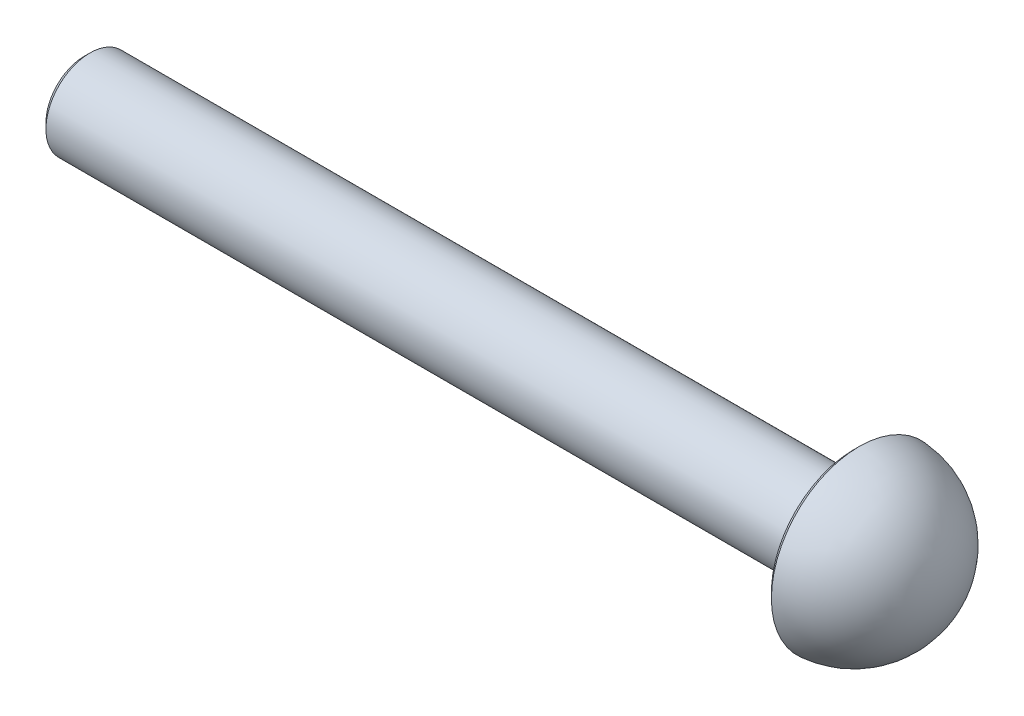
ISO-10303-21;
HEADER;
FILE_DESCRIPTION(('STEP AP214'),'2;1');
FILE_NAME('part.step','',(''),(''),'','','');
FILE_SCHEMA(('AUTOMOTIVE_DESIGN { 1 0 10303 214 1 1 1 1 }'));
ENDSEC;
DATA;
#1=APPLICATION_CONTEXT('core data for automotive mechanical design processes');
#2=APPLICATION_PROTOCOL_DEFINITION('international standard','automotive_design',2000,#1);
#3=PRODUCT_CONTEXT('',#1,'mechanical');
#4=PRODUCT('Part','Part','',(#3));
#5=PRODUCT_RELATED_PRODUCT_CATEGORY('part','',(#4));
#6=PRODUCT_DEFINITION_FORMATION('','',#4);
#7=PRODUCT_DEFINITION_CONTEXT('part definition',#1,'design');
#8=PRODUCT_DEFINITION('design','',#6,#7);
#9=PRODUCT_DEFINITION_SHAPE('','',#8);
#10=(LENGTH_UNIT() NAMED_UNIT(*) SI_UNIT(.MILLI.,.METRE.));
#11=(NAMED_UNIT(*) PLANE_ANGLE_UNIT() SI_UNIT($,.RADIAN.));
#12=(NAMED_UNIT(*) SI_UNIT($,.STERADIAN.) SOLID_ANGLE_UNIT());
#13=UNCERTAINTY_MEASURE_WITH_UNIT(LENGTH_MEASURE(1.E-05),#10,'distance_accuracy_value','');
#14=(GEOMETRIC_REPRESENTATION_CONTEXT(3) GLOBAL_UNCERTAINTY_ASSIGNED_CONTEXT((#13)) GLOBAL_UNIT_ASSIGNED_CONTEXT((#10,
#11,#12)) REPRESENTATION_CONTEXT('',''));
#15=CARTESIAN_POINT('',(0.,0.,0.));
#16=DIRECTION('',(0.,0.,1.));
#17=DIRECTION('',(1.,0.,0.));
#18=AXIS2_PLACEMENT_3D('',#15,#16,#17);
#19=CARTESIAN_POINT('',(35.,0.,0.));
#20=DIRECTION('',(-1.,0.,0.));
#21=DIRECTION('',(0.,1.,0.));
#22=AXIS2_PLACEMENT_3D('',#19,#20,#21);
#23=SPHERICAL_SURFACE('',#22,4.);
#24=CARTESIAN_POINT('',(35.2426342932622,0.,0.));
#25=DIRECTION('',(-1.,0.,0.));
#26=DIRECTION('',(0.,0.,1.));
#27=AXIS2_PLACEMENT_3D('',#24,#25,#26);
#28=CIRCLE('',#27,3.99263429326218);
#29=CARTESIAN_POINT('',(35.2426342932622,0.,3.99263429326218));
#30=VERTEX_POINT('',#29);
#31=EDGE_CURVE('E10',#30,#30,#28,.F.);
#32=ORIENTED_EDGE('',*,*,#31,.T.);
#33=EDGE_LOOP('',(#32));
#34=FACE_BOUND('',#33,.T.);
#35=ADVANCED_FACE('F28',(#34),#23,.T.);
#36=CARTESIAN_POINT('',(35.,2.,0.));
#37=DIRECTION('',(1.,0.,0.));
#38=DIRECTION('',(0.,0.,-1.));
#39=AXIS2_PLACEMENT_3D('',#36,#37,#38);
#40=PLANE('',#39);
#41=CARTESIAN_POINT('',(35.,0.,0.));
#42=DIRECTION('',(1.,0.,0.));
#43=DIRECTION('',(0.,0.,-1.));
#44=AXIS2_PLACEMENT_3D('',#41,#42,#43);
#45=CIRCLE('',#44,2.25);
#46=CARTESIAN_POINT('',(35.,0.,-2.25));
#47=VERTEX_POINT('',#46);
#48=EDGE_CURVE('E39',#47,#47,#45,.T.);
#49=ORIENTED_EDGE('',*,*,#48,.T.);
#50=EDGE_LOOP('',(#49));
#51=FACE_BOUND('',#50,.T.);
#52=CARTESIAN_POINT('',(35.,0.,0.));
#53=DIRECTION('',(1.,0.,0.));
#54=DIRECTION('',(0.,0.,-1.));
#55=AXIS2_PLACEMENT_3D('',#52,#53,#54);
#56=CIRCLE('',#55,3.75);
#57=CARTESIAN_POINT('',(35.,0.,-3.75));
#58=VERTEX_POINT('',#57);
#59=EDGE_CURVE('E43',#58,#58,#56,.F.);
#60=ORIENTED_EDGE('',*,*,#59,.T.);
#61=EDGE_LOOP('',(#60));
#62=FACE_BOUND('',#61,.T.);
#63=ADVANCED_FACE('F70',(#51,#62),#40,.F.);
#64=CARTESIAN_POINT('',(0.,0.,0.));
#65=DIRECTION('',(-1.,0.,0.));
#66=DIRECTION('',(0.,0.,1.));
#67=AXIS2_PLACEMENT_3D('',#64,#65,#66);
#68=CYLINDRICAL_SURFACE('',#67,2.);
#69=CARTESIAN_POINT('',(34.75,0.,0.));
#70=DIRECTION('',(1.,0.,0.));
#71=DIRECTION('',(0.,0.,-1.));
#72=AXIS2_PLACEMENT_3D('',#69,#70,#71);
#73=CIRCLE('',#72,2.);
#74=CARTESIAN_POINT('',(34.75,0.,-2.));
#75=VERTEX_POINT('',#74);
#76=EDGE_CURVE('E48',#75,#75,#73,.F.);
#77=ORIENTED_EDGE('',*,*,#76,.T.);
#78=EDGE_LOOP('',(#77));
#79=FACE_BOUND('',#78,.T.);
#80=CARTESIAN_POINT('',(0.250000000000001,0.,0.));
#81=DIRECTION('',(1.,0.,0.));
#82=DIRECTION('',(0.,0.,-1.));
#83=AXIS2_PLACEMENT_3D('',#80,#81,#82);
#84=CIRCLE('',#83,2.);
#85=CARTESIAN_POINT('',(0.250000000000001,0.,-2.));
#86=VERTEX_POINT('',#85);
#87=EDGE_CURVE('E51',#86,#86,#84,.T.);
#88=ORIENTED_EDGE('',*,*,#87,.T.);
#89=EDGE_LOOP('',(#88));
#90=FACE_BOUND('',#89,.T.);
#91=ADVANCED_FACE('F55',(#79,#90),#68,.T.);
#92=CARTESIAN_POINT('',(0.,0.,0.));
#93=DIRECTION('',(1.,0.,0.));
#94=DIRECTION('',(0.,0.,-1.));
#95=AXIS2_PLACEMENT_3D('',#92,#93,#94);
#96=PLANE('',#95);
#97=CARTESIAN_POINT('',(0.,0.,0.));
#98=DIRECTION('',(1.,0.,0.));
#99=DIRECTION('',(0.,0.,-1.));
#100=AXIS2_PLACEMENT_3D('',#97,#98,#99);
#101=CIRCLE('',#100,1.75);
#102=CARTESIAN_POINT('',(0.,0.,-1.75));
#103=VERTEX_POINT('',#102);
#104=EDGE_CURVE('E35',#103,#103,#101,.F.);
#105=ORIENTED_EDGE('',*,*,#104,.T.);
#106=EDGE_LOOP('',(#105));
#107=FACE_BOUND('',#106,.T.);
#108=ADVANCED_FACE('F66',(#107),#96,.F.);
#109=CARTESIAN_POINT('',(34.75,0.,0.));
#110=DIRECTION('',(1.,0.,0.));
#111=DIRECTION('',(0.,0.,-1.));
#112=AXIS2_PLACEMENT_3D('',#109,#110,#111);
#113=CONICAL_SURFACE('',#112,2.,0.785398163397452);
#114=ORIENTED_EDGE('',*,*,#48,.F.);
#115=EDGE_LOOP('',(#114));
#116=FACE_BOUND('',#115,.T.);
#117=ORIENTED_EDGE('',*,*,#76,.F.);
#118=EDGE_LOOP('',(#117));
#119=FACE_BOUND('',#118,.T.);
#120=ADVANCED_FACE('F60',(#116,#119),#113,.T.);
#121=CARTESIAN_POINT('',(0.,0.,0.));
#122=DIRECTION('',(1.,0.,0.));
#123=DIRECTION('',(0.,0.,-1.));
#124=AXIS2_PLACEMENT_3D('',#121,#122,#123);
#125=CONICAL_SURFACE('',#124,1.75,0.785398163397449);
#126=ORIENTED_EDGE('',*,*,#87,.F.);
#127=EDGE_LOOP('',(#126));
#128=FACE_BOUND('',#127,.T.);
#129=ORIENTED_EDGE('',*,*,#104,.F.);
#130=EDGE_LOOP('',(#129));
#131=FACE_BOUND('',#130,.T.);
#132=ADVANCED_FACE('F57',(#128,#131),#125,.T.);
#133=CARTESIAN_POINT('',(35.,0.,0.));
#134=DIRECTION('',(1.,0.,0.));
#135=DIRECTION('',(0.,0.,-1.));
#136=AXIS2_PLACEMENT_3D('',#133,#134,#135);
#137=CONICAL_SURFACE('',#136,3.75,0.785398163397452);
#138=ORIENTED_EDGE('',*,*,#31,.F.);
#139=EDGE_LOOP('',(#138));
#140=FACE_BOUND('',#139,.T.);
#141=ORIENTED_EDGE('',*,*,#59,.F.);
#142=EDGE_LOOP('',(#141));
#143=FACE_BOUND('',#142,.T.);
#144=ADVANCED_FACE('F30',(#140,#143),#137,.T.);
#145=CLOSED_SHELL('',(#35,#63,#91,#108,#120,#132,#144));
#146=MANIFOLD_SOLID_BREP('B2',#145);
#147=ADVANCED_BREP_SHAPE_REPRESENTATION('',(#18,#146),#14);
#148=SHAPE_DEFINITION_REPRESENTATION(#9,#147);
ENDSEC;
END-ISO-10303-21;
